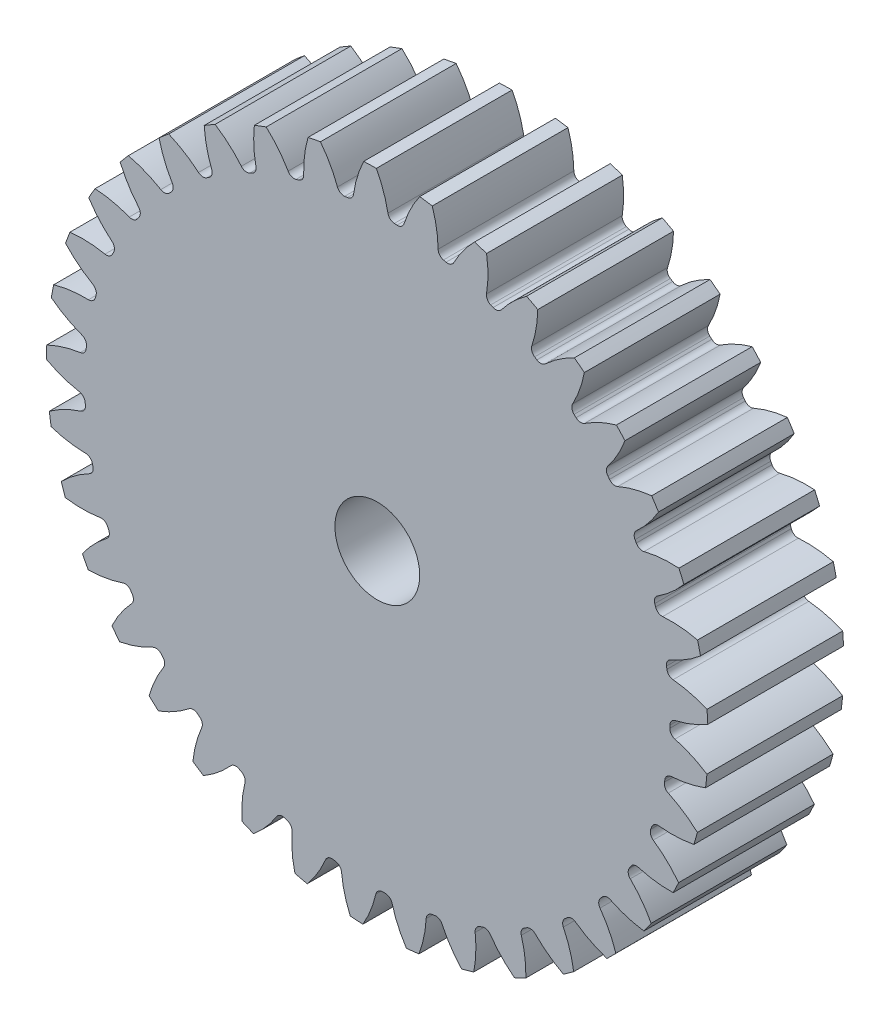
from build123d import *

# Parameters (mm, degrees)
SKETCH3_R         = 247.65
GEARBODY_DEPTH    = 101.6
TOOTHCUT_DEPTH    = 365.66917199
CIRPATTERN1_COUNT = 37
BOREDIA_R         = 31.75
BORE_DEPTH        = 12700


with BuildPart() as part:
    # Sketch3 → gearBody (new body)
    with BuildSketch(Plane.XY):
        Circle(SKETCH3_R)
    extrude(amount=GEARBODY_DEPTH)

    # Sketch2 → toothCut (cut, through all)
    with BuildSketch(Plane.XY):
        with BuildLine():
            ThreePointArc((219.006750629, -5.467979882), (219.02968904, -4.455439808), (219.047946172, -3.442804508))
            ThreePointArc((219.047946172, -3.442804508), (220.197762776, -0.272938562), (223.057701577, 1.513364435))
            ThreePointArc((223.057701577, 1.513364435), (235.741055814, 5.495199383), (247.65, 11.402782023))
            ThreePointArc((247.65, 11.402782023), (247.861100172, -5.041920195), (246.981424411, -21.464434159))
            ThreePointArc((246.981424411, -21.464434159), (235.322572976, -15.077442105), (222.811638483, -10.583112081))
            ThreePointArc((222.811638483, -10.583112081), (220.026708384, -8.681982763), (219.006750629, -5.467979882))
        make_face()
    toothcut = extrude(amount=TOOTHCUT_DEPTH, mode=Mode.SUBTRACT)

    # CirPattern1: toothCut ×37 about axis
    cirpattern1_axis = Axis((0, 0, 0), (0, 0, 1))
    for i in range(1, CIRPATTERN1_COUNT):
        add(toothcut.rotate(cirpattern1_axis, i * 360 / CIRPATTERN1_COUNT), mode=Mode.SUBTRACT)

    # boreDia → bore (cut, symmetric)
    with BuildSketch(Plane.XY):
        Circle(BOREDIA_R)
    extrude(amount=BORE_DEPTH, both=True, mode=Mode.SUBTRACT)


solid = part.part
